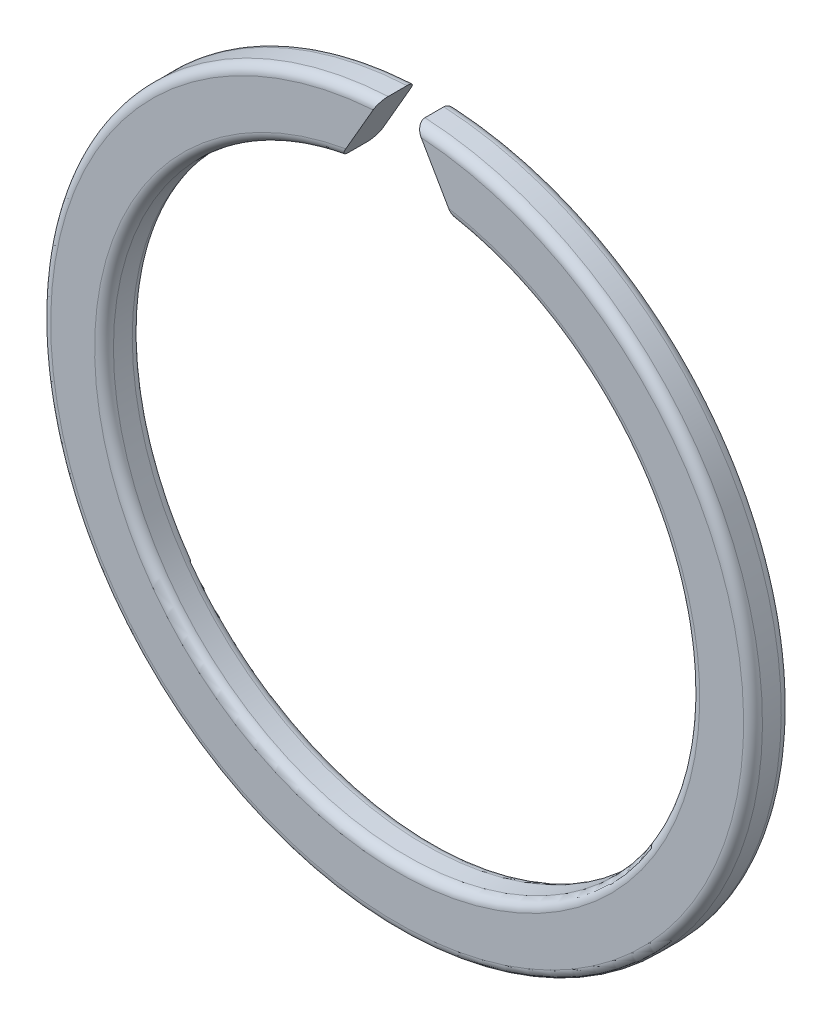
ISO-10303-21;
HEADER;
FILE_DESCRIPTION(('STEP AP214'),'2;1');
FILE_NAME('part.step','',(''),(''),'','','');
FILE_SCHEMA(('AUTOMOTIVE_DESIGN { 1 0 10303 214 1 1 1 1 }'));
ENDSEC;
DATA;
#1=APPLICATION_CONTEXT('core data for automotive mechanical design processes');
#2=APPLICATION_PROTOCOL_DEFINITION('international standard','automotive_design',2000,#1);
#3=PRODUCT_CONTEXT('',#1,'mechanical');
#4=PRODUCT('Part','Part','',(#3));
#5=PRODUCT_RELATED_PRODUCT_CATEGORY('part','',(#4));
#6=PRODUCT_DEFINITION_FORMATION('','',#4);
#7=PRODUCT_DEFINITION_CONTEXT('part definition',#1,'design');
#8=PRODUCT_DEFINITION('design','',#6,#7);
#9=PRODUCT_DEFINITION_SHAPE('','',#8);
#10=(LENGTH_UNIT() NAMED_UNIT(*) SI_UNIT(.MILLI.,.METRE.));
#11=(NAMED_UNIT(*) PLANE_ANGLE_UNIT() SI_UNIT($,.RADIAN.));
#12=(NAMED_UNIT(*) SI_UNIT($,.STERADIAN.) SOLID_ANGLE_UNIT());
#13=UNCERTAINTY_MEASURE_WITH_UNIT(LENGTH_MEASURE(1.E-05),#10,'distance_accuracy_value','');
#14=(GEOMETRIC_REPRESENTATION_CONTEXT(3) GLOBAL_UNCERTAINTY_ASSIGNED_CONTEXT((#13)) GLOBAL_UNIT_ASSIGNED_CONTEXT((#10,
#11,#12)) REPRESENTATION_CONTEXT('',''));
#15=CARTESIAN_POINT('',(0.,0.,0.));
#16=DIRECTION('',(0.,0.,1.));
#17=DIRECTION('',(1.,0.,0.));
#18=AXIS2_PLACEMENT_3D('',#15,#16,#17);
#19=CARTESIAN_POINT('',(0.,0.,1.2));
#20=DIRECTION('',(0.,0.,1.));
#21=DIRECTION('',(1.,0.,0.));
#22=AXIS2_PLACEMENT_3D('',#19,#20,#21);
#23=PLANE('',#22);
#24=DIRECTION('',(-0.500000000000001,0.866025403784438,0.));
#25=VECTOR('',#24,1.);
#26=CARTESIAN_POINT('',(0.,12.35,1.2));
#27=LINE('',#26,#25);
#28=CARTESIAN_POINT('',(1.63988152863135,9.5096418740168,1.2));
#29=VERTEX_POINT('',#28);
#30=CARTESIAN_POINT('',(0.765898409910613,11.0234250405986,1.2));
#31=VERTEX_POINT('',#30);
#32=EDGE_CURVE('E135',#29,#31,#27,.T.);
#33=ORIENTED_EDGE('',*,*,#32,.F.);
#34=CARTESIAN_POINT('',(0.,0.,1.2));
#35=DIRECTION('',(0.,0.,1.));
#36=DIRECTION('',(1.,0.,0.));
#37=AXIS2_PLACEMENT_3D('',#34,#35,#36);
#38=CIRCLE('',#37,9.65);
#39=CARTESIAN_POINT('',(-1.63988152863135,9.5096418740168,1.2));
#40=VERTEX_POINT('',#39);
#41=EDGE_CURVE('E11',#29,#40,#38,.F.);
#42=ORIENTED_EDGE('',*,*,#41,.T.);
#43=DIRECTION('',(-0.500000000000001,-0.866025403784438,0.));
#44=VECTOR('',#43,1.);
#45=CARTESIAN_POINT('',(0.,12.35,1.2));
#46=LINE('',#45,#44);
#47=CARTESIAN_POINT('',(-0.765898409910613,11.0234250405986,1.2));
#48=VERTEX_POINT('',#47);
#49=EDGE_CURVE('E134',#48,#40,#46,.T.);
#50=ORIENTED_EDGE('',*,*,#49,.F.);
#51=CARTESIAN_POINT('',(0.,0.,1.2));
#52=DIRECTION('',(0.,0.,1.));
#53=DIRECTION('',(1.,0.,0.));
#54=AXIS2_PLACEMENT_3D('',#51,#52,#53);
#55=CIRCLE('',#54,11.05);
#56=EDGE_CURVE('E48',#48,#31,#55,.T.);
#57=ORIENTED_EDGE('',*,*,#56,.T.);
#58=EDGE_LOOP('',(#33,#42,#50,#57));
#59=FACE_BOUND('',#58,.T.);
#60=ADVANCED_FACE('F39',(#59),#23,.T.);
#61=CARTESIAN_POINT('',(0.,0.,0.));
#62=DIRECTION('',(0.,0.,1.));
#63=DIRECTION('',(1.,0.,0.));
#64=AXIS2_PLACEMENT_3D('',#61,#62,#63);
#65=PLANE('',#64);
#66=DIRECTION('',(-0.500000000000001,-0.866025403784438,0.));
#67=VECTOR('',#66,1.);
#68=CARTESIAN_POINT('',(0.,12.35,0.));
#69=LINE('',#68,#67);
#70=CARTESIAN_POINT('',(-0.765898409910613,11.0234250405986,0.));
#71=VERTEX_POINT('',#70);
#72=CARTESIAN_POINT('',(-1.63988152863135,9.5096418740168,0.));
#73=VERTEX_POINT('',#72);
#74=EDGE_CURVE('E123',#71,#73,#69,.T.);
#75=ORIENTED_EDGE('',*,*,#74,.T.);
#76=CARTESIAN_POINT('',(0.,0.,0.));
#77=DIRECTION('',(0.,0.,1.));
#78=DIRECTION('',(1.,0.,0.));
#79=AXIS2_PLACEMENT_3D('',#76,#77,#78);
#80=CIRCLE('',#79,9.65);
#81=CARTESIAN_POINT('',(1.63988152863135,9.5096418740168,0.));
#82=VERTEX_POINT('',#81);
#83=EDGE_CURVE('E107',#73,#82,#80,.T.);
#84=ORIENTED_EDGE('',*,*,#83,.T.);
#85=DIRECTION('',(-0.500000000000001,0.866025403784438,0.));
#86=VECTOR('',#85,1.);
#87=CARTESIAN_POINT('',(0.,12.35,0.));
#88=LINE('',#87,#86);
#89=CARTESIAN_POINT('',(0.765898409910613,11.0234250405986,0.));
#90=VERTEX_POINT('',#89);
#91=EDGE_CURVE('E125',#82,#90,#88,.T.);
#92=ORIENTED_EDGE('',*,*,#91,.T.);
#93=CARTESIAN_POINT('',(0.,0.,0.));
#94=DIRECTION('',(0.,0.,1.));
#95=DIRECTION('',(1.,0.,0.));
#96=AXIS2_PLACEMENT_3D('',#93,#94,#95);
#97=CIRCLE('',#96,11.05);
#98=EDGE_CURVE('E129',#90,#71,#97,.F.);
#99=ORIENTED_EDGE('',*,*,#98,.T.);
#100=EDGE_LOOP('',(#75,#84,#92,#99));
#101=FACE_BOUND('',#100,.T.);
#102=ADVANCED_FACE('F122',(#101),#65,.F.);
#103=CARTESIAN_POINT('',(0.,0.,1.2));
#104=DIRECTION('',(0.,0.,-1.));
#105=DIRECTION('',(-1.,0.,0.));
#106=AXIS2_PLACEMENT_3D('',#103,#104,#105);
#107=CYLINDRICAL_SURFACE('',#106,11.35);
#108=DIRECTION('',(0.,0.,-1.));
#109=VECTOR('',#108,1.);
#110=CARTESIAN_POINT('',(-0.586092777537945,11.3348575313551,1.2));
#111=LINE('',#110,#109);
#112=CARTESIAN_POINT('',(-0.586092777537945,11.3348575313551,0.3));
#113=VERTEX_POINT('',#112);
#114=CARTESIAN_POINT('',(-0.586092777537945,11.3348575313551,0.9));
#115=VERTEX_POINT('',#114);
#116=EDGE_CURVE('E141',#113,#115,#111,.F.);
#117=ORIENTED_EDGE('',*,*,#116,.F.);
#118=CARTESIAN_POINT('',(0.,0.,0.3));
#119=DIRECTION('',(0.,0.,1.));
#120=DIRECTION('',(1.,0.,0.));
#121=AXIS2_PLACEMENT_3D('',#118,#119,#120);
#122=CIRCLE('',#121,11.35);
#123=CARTESIAN_POINT('',(0.586092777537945,11.3348575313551,0.3));
#124=VERTEX_POINT('',#123);
#125=EDGE_CURVE('E212',#113,#124,#122,.T.);
#126=ORIENTED_EDGE('',*,*,#125,.T.);
#127=DIRECTION('',(0.,0.,-1.));
#128=VECTOR('',#127,1.);
#129=CARTESIAN_POINT('',(0.586092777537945,11.3348575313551,1.2));
#130=LINE('',#129,#128);
#131=CARTESIAN_POINT('',(0.586092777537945,11.3348575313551,0.9));
#132=VERTEX_POINT('',#131);
#133=EDGE_CURVE('E143',#132,#124,#130,.T.);
#134=ORIENTED_EDGE('',*,*,#133,.F.);
#135=CARTESIAN_POINT('',(0.,0.,0.9));
#136=DIRECTION('',(0.,0.,1.));
#137=DIRECTION('',(1.,0.,0.));
#138=AXIS2_PLACEMENT_3D('',#135,#136,#137);
#139=CIRCLE('',#138,11.35);
#140=EDGE_CURVE('E213',#132,#115,#139,.F.);
#141=ORIENTED_EDGE('',*,*,#140,.T.);
#142=EDGE_LOOP('',(#117,#126,#134,#141));
#143=FACE_BOUND('',#142,.T.);
#144=ADVANCED_FACE('F232',(#143),#107,.T.);
#145=CARTESIAN_POINT('',(0.,0.,1.2));
#146=DIRECTION('',(0.,0.,-1.));
#147=DIRECTION('',(-1.,0.,0.));
#148=AXIS2_PLACEMENT_3D('',#145,#146,#147);
#149=CYLINDRICAL_SURFACE('',#148,9.35);
#150=DIRECTION('',(0.,0.,-1.));
#151=VECTOR('',#150,1.);
#152=CARTESIAN_POINT('',(1.83729823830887,9.16770610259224,1.2));
#153=LINE('',#152,#151);
#154=CARTESIAN_POINT('',(1.83729823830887,9.16770610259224,0.9));
#155=VERTEX_POINT('',#154);
#156=CARTESIAN_POINT('',(1.83729823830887,9.16770610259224,0.3));
#157=VERTEX_POINT('',#156);
#158=EDGE_CURVE('E136',#155,#157,#153,.T.);
#159=ORIENTED_EDGE('',*,*,#158,.T.);
#160=CARTESIAN_POINT('',(0.,0.,0.3));
#161=DIRECTION('',(0.,0.,1.));
#162=DIRECTION('',(1.,0.,0.));
#163=AXIS2_PLACEMENT_3D('',#160,#161,#162);
#164=CIRCLE('',#163,9.35);
#165=CARTESIAN_POINT('',(-1.83729823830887,9.16770610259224,0.3));
#166=VERTEX_POINT('',#165);
#167=EDGE_CURVE('E109',#157,#166,#164,.F.);
#168=ORIENTED_EDGE('',*,*,#167,.T.);
#169=DIRECTION('',(0.,0.,-1.));
#170=VECTOR('',#169,1.);
#171=CARTESIAN_POINT('',(-1.83729823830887,9.16770610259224,1.2));
#172=LINE('',#171,#170);
#173=CARTESIAN_POINT('',(-1.83729823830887,9.16770610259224,0.9));
#174=VERTEX_POINT('',#173);
#175=EDGE_CURVE('E137',#174,#166,#172,.T.);
#176=ORIENTED_EDGE('',*,*,#175,.F.);
#177=CARTESIAN_POINT('',(0.,0.,0.9));
#178=DIRECTION('',(0.,0.,1.));
#179=DIRECTION('',(1.,0.,0.));
#180=AXIS2_PLACEMENT_3D('',#177,#178,#179);
#181=CIRCLE('',#180,9.35);
#182=EDGE_CURVE('E114',#174,#155,#181,.T.);
#183=ORIENTED_EDGE('',*,*,#182,.T.);
#184=EDGE_LOOP('',(#159,#168,#176,#183));
#185=FACE_BOUND('',#184,.T.);
#186=ADVANCED_FACE('F168',(#185),#149,.F.);
#187=CARTESIAN_POINT('',(0.,12.35,1.2));
#188=DIRECTION('',(0.866025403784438,-0.500000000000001,0.));
#189=DIRECTION('',(0.500000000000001,0.866025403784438,0.));
#190=AXIS2_PLACEMENT_3D('',#187,#188,#189);
#191=PLANE('',#190);
#192=ORIENTED_EDGE('',*,*,#175,.T.);
#193=CARTESIAN_POINT('',(-1.83729823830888,9.16770610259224,0.3));
#194=CARTESIAN_POINT('',(-1.8373132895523,9.16768003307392,0.28601958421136));
#195=CARTESIAN_POINT('',(-1.83664855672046,9.16883138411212,0.272069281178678));
#196=CARTESIAN_POINT('',(-1.83408882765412,9.17326496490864,0.244732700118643));
#197=CARTESIAN_POINT('',(-1.83220321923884,9.17653093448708,0.231342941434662));
#198=CARTESIAN_POINT('',(-1.82733309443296,9.18496623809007,0.205436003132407));
#199=CARTESIAN_POINT('',(-1.82435106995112,9.19013125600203,0.192916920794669));
#200=CARTESIAN_POINT('',(-1.81745859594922,9.20206937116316,0.168929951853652));
#201=CARTESIAN_POINT('',(-1.81354631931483,9.20884563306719,0.157464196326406));
#202=CARTESIAN_POINT('',(-1.80344507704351,9.22634149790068,0.131881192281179));
#203=CARTESIAN_POINT('',(-1.79694045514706,9.23760783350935,0.11826238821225));
#204=CARTESIAN_POINT('',(-1.78291540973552,9.26189992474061,0.0933149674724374));
#205=CARTESIAN_POINT('',(-1.77539334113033,9.27492852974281,0.0819901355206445));
#206=CARTESIAN_POINT('',(-1.75727514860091,9.30631015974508,0.0585728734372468));
#207=CARTESIAN_POINT('',(-1.74642987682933,9.32509472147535,0.0472528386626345));
#208=CARTESIAN_POINT('',(-1.72396465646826,9.36400562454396,0.0282718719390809));
#209=CARTESIAN_POINT('',(-1.71234364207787,9.3841338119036,0.0206160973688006));
#210=CARTESIAN_POINT('',(-1.69057737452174,9.42183409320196,0.00979952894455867));
#211=CARTESIAN_POINT('',(-1.68049585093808,9.43929580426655,0.0061134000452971));
#212=CARTESIAN_POINT('',(-1.66023573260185,9.47438735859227,0.00122372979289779));
#213=CARTESIAN_POINT('',(-1.65005790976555,9.49201586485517,7.44482155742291E-06));
#214=CARTESIAN_POINT('',(-1.63988152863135,9.5096418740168,0.));
#215=B_SPLINE_CURVE_WITH_KNOTS('',3,(#193,#194,#195,#196,#197,#198,#199,#200,#201,#202,#203,
#204,#205,#206,#207,#208,#209,#210,#211,#212,#213,#214),.UNSPECIFIED.,.F.,.F.,(4,2,2,2,2,2,2,2,
2,2,4),(0.,0.0418304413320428,0.0833429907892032,0.124761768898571,0.1662625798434,
0.222456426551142,0.278742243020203,0.351758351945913,0.424876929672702,0.486220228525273,
0.54724620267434),.UNSPECIFIED.);
#216=EDGE_CURVE('E197',#166,#73,#215,.T.);
#217=ORIENTED_EDGE('',*,*,#216,.T.);
#218=ORIENTED_EDGE('',*,*,#74,.F.);
#219=CARTESIAN_POINT('',(-0.765898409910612,11.0234250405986,0.));
#220=CARTESIAN_POINT('',(-0.753199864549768,11.0454195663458,7.80616742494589E-07));
#221=CARTESIAN_POINT('',(-0.740477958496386,11.0674545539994,0.0022200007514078));
#222=CARTESIAN_POINT('',(-0.715321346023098,11.1110270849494,0.0112042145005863));
#223=CARTESIAN_POINT('',(-0.702890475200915,11.1325579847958,0.0180118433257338));
#224=CARTESIAN_POINT('',(-0.679736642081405,11.1726616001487,0.0356521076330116));
#225=CARTESIAN_POINT('',(-0.668955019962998,11.1913359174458,0.0461734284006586));
#226=CARTESIAN_POINT('',(-0.648667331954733,11.2264752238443,0.0712212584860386));
#227=CARTESIAN_POINT('',(-0.639155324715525,11.2429505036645,0.085728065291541));
#228=CARTESIAN_POINT('',(-0.624596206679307,11.2681676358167,0.113490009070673));
#229=CARTESIAN_POINT('',(-0.619075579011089,11.2777296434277,0.125758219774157));
#230=CARTESIAN_POINT('',(-0.609114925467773,11.2949820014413,0.151964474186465));
#231=CARTESIAN_POINT('',(-0.604675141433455,11.3026719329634,0.165902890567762));
#232=CARTESIAN_POINT('',(-0.597077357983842,11.315831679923,0.195240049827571));
#233=CARTESIAN_POINT('',(-0.593928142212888,11.3212862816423,0.210647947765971));
#234=CARTESIAN_POINT('',(-0.589154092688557,11.3295551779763,0.242365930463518));
#235=CARTESIAN_POINT('',(-0.587525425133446,11.3323761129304,0.258673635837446));
#236=CARTESIAN_POINT('',(-0.586503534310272,11.3341460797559,0.279250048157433));
#237=CARTESIAN_POINT('',(-0.586349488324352,11.3344128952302,0.283397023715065));
#238=CARTESIAN_POINT('',(-0.586144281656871,11.3347683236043,0.291695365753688));
#239=CARTESIAN_POINT('',(-0.586092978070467,11.3348571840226,0.295846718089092));
#240=CARTESIAN_POINT('',(-0.586092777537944,11.3348575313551,0.3));
#241=B_SPLINE_CURVE_WITH_KNOTS('',3,(#219,#220,#221,#222,#223,#224,#225,#226,#227,#228,#229,
#230,#231,#232,#233,#234,#235,#236,#237,#238,#239,#240),.UNSPECIFIED.,.F.,.F.,(4,2,2,2,2,2,2,2,
2,2,4),(0.,0.0761739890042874,0.153065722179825,0.224633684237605,0.295854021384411,
0.345173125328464,0.39450325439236,0.444163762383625,0.493698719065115,0.506170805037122,
0.518625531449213),.UNSPECIFIED.);
#242=EDGE_CURVE('E194',#71,#113,#241,.T.);
#243=ORIENTED_EDGE('',*,*,#242,.T.);
#244=ORIENTED_EDGE('',*,*,#116,.T.);
#245=CARTESIAN_POINT('',(-0.586092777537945,11.3348575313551,0.9));
#246=CARTESIAN_POINT('',(-0.586080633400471,11.3348785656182,0.914935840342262));
#247=CARTESIAN_POINT('',(-0.586756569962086,11.3337078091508,0.929852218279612));
#248=CARTESIAN_POINT('',(-0.58938524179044,11.3291548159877,0.959154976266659));
#249=CARTESIAN_POINT('',(-0.591331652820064,11.325783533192,0.973543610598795));
#250=CARTESIAN_POINT('',(-0.596400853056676,11.3170034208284,1.00144021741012));
#251=CARTESIAN_POINT('',(-0.599522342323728,11.3115968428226,1.01494914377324));
#252=CARTESIAN_POINT('',(-0.606794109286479,11.2990017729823,1.04081763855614));
#253=CARTESIAN_POINT('',(-0.610945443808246,11.2918114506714,1.05317600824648));
#254=CARTESIAN_POINT('',(-0.620382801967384,11.2754654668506,1.07721136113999));
#255=CARTESIAN_POINT('',(-0.625721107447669,11.2662192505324,1.08880583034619));
#256=CARTESIAN_POINT('',(-0.637176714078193,11.2463775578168,1.11032260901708));
#257=CARTESIAN_POINT('',(-0.643294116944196,11.2357819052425,1.12024469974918));
#258=CARTESIAN_POINT('',(-0.657117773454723,11.2118386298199,1.13973613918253));
#259=CARTESIAN_POINT('',(-0.664924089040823,11.1983176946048,1.14902131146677));
#260=CARTESIAN_POINT('',(-0.681126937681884,11.1702535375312,1.16527199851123));
#261=CARTESIAN_POINT('',(-0.689524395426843,11.1557087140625,1.17223377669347));
#262=CARTESIAN_POINT('',(-0.709021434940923,11.1219388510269,1.18539834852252));
#263=CARTESIAN_POINT('',(-0.720240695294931,11.1025065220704,1.19089434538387));
#264=CARTESIAN_POINT('',(-0.742945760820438,11.0631801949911,1.19819010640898));
#265=CARTESIAN_POINT('',(-0.754430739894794,11.0432876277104,1.20000008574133));
#266=CARTESIAN_POINT('',(-0.765898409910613,11.0234250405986,1.2));
#267=B_SPLINE_CURVE_WITH_KNOTS('',3,(#245,#246,#247,#248,#249,#250,#251,#252,#253,#254,#255,
#256,#257,#258,#259,#260,#261,#262,#263,#264,#265,#266),.UNSPECIFIED.,.F.,.F.,(4,2,2,2,2,2,2,2,
2,2,4),(0.,0.0447158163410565,0.0892107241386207,0.133656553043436,0.178148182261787,
0.225250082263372,0.272358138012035,0.326645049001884,0.381018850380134,0.450005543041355,
0.518800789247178),.UNSPECIFIED.);
#268=EDGE_CURVE('E58',#115,#48,#267,.T.);
#269=ORIENTED_EDGE('',*,*,#268,.T.);
#270=ORIENTED_EDGE('',*,*,#49,.T.);
#271=CARTESIAN_POINT('',(-1.63988152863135,9.5096418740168,1.2));
#272=CARTESIAN_POINT('',(-1.65252408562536,9.48774432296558,1.19998464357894));
#273=CARTESIAN_POINT('',(-1.66518073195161,9.46582236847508,1.19810986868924));
#274=CARTESIAN_POINT('',(-1.69028872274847,9.42233405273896,1.19054833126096));
#275=CARTESIAN_POINT('',(-1.70273818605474,9.40077094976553,1.18483674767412));
#276=CARTESIAN_POINT('',(-1.7259318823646,9.36059828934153,1.1701965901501));
#277=CARTESIAN_POINT('',(-1.73672874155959,9.34189758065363,1.1616038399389));
#278=CARTESIAN_POINT('',(-1.75748097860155,9.30595365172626,1.14106547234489));
#279=CARTESIAN_POINT('',(-1.76743834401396,9.28870698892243,1.12912808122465));
#280=CARTESIAN_POINT('',(-1.78384343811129,9.2602925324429,1.10508177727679));
#281=CARTESIAN_POINT('',(-1.79055918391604,9.24866051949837,1.09370510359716));
#282=CARTESIAN_POINT('',(-1.80300180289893,9.22710927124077,1.06894855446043));
#283=CARTESIAN_POINT('',(-1.80872969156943,9.21718827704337,1.05557076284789));
#284=CARTESIAN_POINT('',(-1.8179321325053,9.20124918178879,1.02960332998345));
#285=CARTESIAN_POINT('',(-1.82162757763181,9.19484848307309,1.01732772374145));
#286=CARTESIAN_POINT('',(-1.82795121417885,9.18389562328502,0.991733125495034));
#287=CARTESIAN_POINT('',(-1.83058157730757,9.17933970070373,0.978416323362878));
#288=CARTESIAN_POINT('',(-1.83413388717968,9.173186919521,0.954259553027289));
#289=CARTESIAN_POINT('',(-1.8353115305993,9.17114718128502,0.943568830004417));
#290=CARTESIAN_POINT('',(-1.83689790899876,9.16839949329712,0.921923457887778));
#291=CARTESIAN_POINT('',(-1.83730384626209,9.16769638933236,0.910967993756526));
#292=CARTESIAN_POINT('',(-1.83729823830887,9.16770610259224,0.9));
#293=B_SPLINE_CURVE_WITH_KNOTS('',3,(#271,#272,#273,#274,#275,#276,#277,#278,#279,#280,#281,
#282,#283,#284,#285,#286,#287,#288,#289,#290,#291,#292),.UNSPECIFIED.,.F.,.F.,(4,2,2,2,2,2,2,2,
2,2,4),(0.,0.0758360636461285,0.152167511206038,0.221628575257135,0.290920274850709,
0.343541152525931,0.396107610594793,0.438924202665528,0.481653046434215,0.514387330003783,
0.54724006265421),.UNSPECIFIED.);
#294=EDGE_CURVE('E199',#40,#174,#293,.T.);
#295=ORIENTED_EDGE('',*,*,#294,.T.);
#296=EDGE_LOOP('',(#192,#217,#218,#243,#244,#269,#270,#295));
#297=FACE_BOUND('',#296,.T.);
#298=ADVANCED_FACE('F165',(#297),#191,.T.);
#299=CARTESIAN_POINT('',(0.,12.35,1.2));
#300=DIRECTION('',(-0.866025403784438,-0.500000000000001,0.));
#301=DIRECTION('',(0.500000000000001,-0.866025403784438,0.));
#302=AXIS2_PLACEMENT_3D('',#299,#300,#301);
#303=PLANE('',#302);
#304=ORIENTED_EDGE('',*,*,#91,.F.);
#305=CARTESIAN_POINT('',(1.63988152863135,9.5096418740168,0.));
#306=CARTESIAN_POINT('',(1.65252408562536,9.48774432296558,1.53564210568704E-05));
#307=CARTESIAN_POINT('',(1.66518073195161,9.46582236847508,0.00189013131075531));
#308=CARTESIAN_POINT('',(1.69028872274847,9.42233405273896,0.00945166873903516));
#309=CARTESIAN_POINT('',(1.70273818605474,9.40077094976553,0.0151632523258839));
#310=CARTESIAN_POINT('',(1.7259318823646,9.36059828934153,0.0298034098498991));
#311=CARTESIAN_POINT('',(1.73672874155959,9.34189758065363,0.0383961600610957));
#312=CARTESIAN_POINT('',(1.75748097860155,9.30595365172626,0.0589345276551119));
#313=CARTESIAN_POINT('',(1.76743834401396,9.28870698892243,0.0708719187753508));
#314=CARTESIAN_POINT('',(1.78384343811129,9.2602925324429,0.0949182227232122));
#315=CARTESIAN_POINT('',(1.79055918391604,9.24866051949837,0.106294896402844));
#316=CARTESIAN_POINT('',(1.80300180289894,9.22710927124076,0.131051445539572));
#317=CARTESIAN_POINT('',(1.80872969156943,9.21718827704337,0.144429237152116));
#318=CARTESIAN_POINT('',(1.8179321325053,9.20124918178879,0.170396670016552));
#319=CARTESIAN_POINT('',(1.82162757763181,9.19484848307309,0.182672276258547));
#320=CARTESIAN_POINT('',(1.82795121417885,9.18389562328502,0.208266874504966));
#321=CARTESIAN_POINT('',(1.83058157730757,9.17933970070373,0.221583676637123));
#322=CARTESIAN_POINT('',(1.83413388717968,9.173186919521,0.245740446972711));
#323=CARTESIAN_POINT('',(1.8353115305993,9.17114718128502,0.256431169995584));
#324=CARTESIAN_POINT('',(1.83689790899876,9.16839949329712,0.278076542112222));
#325=CARTESIAN_POINT('',(1.83730384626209,9.16769638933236,0.289032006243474));
#326=CARTESIAN_POINT('',(1.83729823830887,9.16770610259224,0.3));
#327=B_SPLINE_CURVE_WITH_KNOTS('',3,(#305,#306,#307,#308,#309,#310,#311,#312,#313,#314,#315,
#316,#317,#318,#319,#320,#321,#322,#323,#324,#325,#326),.UNSPECIFIED.,.F.,.F.,(4,2,2,2,2,2,2,2,
2,2,4),(0.,0.0758360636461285,0.152167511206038,0.221628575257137,0.290920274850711,
0.343541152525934,0.396107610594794,0.438924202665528,0.481653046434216,0.514387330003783,
0.547240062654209),.UNSPECIFIED.);
#328=EDGE_CURVE('E102',#82,#157,#327,.T.);
#329=ORIENTED_EDGE('',*,*,#328,.T.);
#330=ORIENTED_EDGE('',*,*,#158,.F.);
#331=CARTESIAN_POINT('',(1.83729823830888,9.16770610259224,0.9));
#332=CARTESIAN_POINT('',(1.8373132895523,9.16768003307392,0.91398041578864));
#333=CARTESIAN_POINT('',(1.83664855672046,9.16883138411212,0.927930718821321));
#334=CARTESIAN_POINT('',(1.83408882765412,9.17326496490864,0.955267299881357));
#335=CARTESIAN_POINT('',(1.83220321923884,9.17653093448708,0.968657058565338));
#336=CARTESIAN_POINT('',(1.82733309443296,9.18496623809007,0.994563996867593));
#337=CARTESIAN_POINT('',(1.82435106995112,9.19013125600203,1.00708307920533));
#338=CARTESIAN_POINT('',(1.81745859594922,9.20206937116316,1.03107004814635));
#339=CARTESIAN_POINT('',(1.81354631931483,9.20884563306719,1.04253580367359));
#340=CARTESIAN_POINT('',(1.80344507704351,9.22634149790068,1.06811880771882));
#341=CARTESIAN_POINT('',(1.79694045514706,9.23760783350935,1.08173761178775));
#342=CARTESIAN_POINT('',(1.78291540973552,9.26189992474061,1.10668503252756));
#343=CARTESIAN_POINT('',(1.77539334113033,9.27492852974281,1.11800986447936));
#344=CARTESIAN_POINT('',(1.75727514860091,9.30631015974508,1.14142712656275));
#345=CARTESIAN_POINT('',(1.74642987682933,9.32509472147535,1.15274716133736));
#346=CARTESIAN_POINT('',(1.72396465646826,9.36400562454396,1.17172812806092));
#347=CARTESIAN_POINT('',(1.71234364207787,9.3841338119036,1.1793839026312));
#348=CARTESIAN_POINT('',(1.69057737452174,9.42183409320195,1.19020047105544));
#349=CARTESIAN_POINT('',(1.68049585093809,9.43929580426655,1.1938865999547));
#350=CARTESIAN_POINT('',(1.66023573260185,9.47438735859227,1.1987762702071));
#351=CARTESIAN_POINT('',(1.65005790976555,9.49201586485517,1.19999255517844));
#352=CARTESIAN_POINT('',(1.63988152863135,9.5096418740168,1.2));
#353=B_SPLINE_CURVE_WITH_KNOTS('',3,(#331,#332,#333,#334,#335,#336,#337,#338,#339,#340,#341,
#342,#343,#344,#345,#346,#347,#348,#349,#350,#351,#352),.UNSPECIFIED.,.F.,.F.,(4,2,2,2,2,2,2,2,
2,2,4),(0.,0.0418304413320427,0.0833429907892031,0.12476176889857,0.1662625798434,
0.222456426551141,0.278742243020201,0.351758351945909,0.424876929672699,0.486220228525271,
0.547246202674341),.UNSPECIFIED.);
#354=EDGE_CURVE('E152',#155,#29,#353,.T.);
#355=ORIENTED_EDGE('',*,*,#354,.T.);
#356=ORIENTED_EDGE('',*,*,#32,.T.);
#357=CARTESIAN_POINT('',(0.765898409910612,11.0234250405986,1.2));
#358=CARTESIAN_POINT('',(0.753199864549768,11.0454195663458,1.19999921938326));
#359=CARTESIAN_POINT('',(0.740477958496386,11.0674545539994,1.19777999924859));
#360=CARTESIAN_POINT('',(0.715321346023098,11.1110270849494,1.18879578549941));
#361=CARTESIAN_POINT('',(0.702890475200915,11.1325579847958,1.18198815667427));
#362=CARTESIAN_POINT('',(0.679736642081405,11.1726616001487,1.16434789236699));
#363=CARTESIAN_POINT('',(0.668955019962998,11.1913359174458,1.15382657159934));
#364=CARTESIAN_POINT('',(0.648667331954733,11.2264752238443,1.12877874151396));
#365=CARTESIAN_POINT('',(0.639155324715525,11.2429505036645,1.11427193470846));
#366=CARTESIAN_POINT('',(0.624596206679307,11.2681676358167,1.08650999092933));
#367=CARTESIAN_POINT('',(0.619075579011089,11.2777296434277,1.07424178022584));
#368=CARTESIAN_POINT('',(0.609114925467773,11.2949820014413,1.04803552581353));
#369=CARTESIAN_POINT('',(0.604675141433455,11.3026719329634,1.03409710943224));
#370=CARTESIAN_POINT('',(0.597077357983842,11.315831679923,1.00475995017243));
#371=CARTESIAN_POINT('',(0.593928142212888,11.3212862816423,0.989352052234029));
#372=CARTESIAN_POINT('',(0.589154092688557,11.3295551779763,0.957634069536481));
#373=CARTESIAN_POINT('',(0.587525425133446,11.3323761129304,0.941326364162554));
#374=CARTESIAN_POINT('',(0.586503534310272,11.3341460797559,0.920749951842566));
#375=CARTESIAN_POINT('',(0.586349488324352,11.3344128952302,0.916602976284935));
#376=CARTESIAN_POINT('',(0.586144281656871,11.3347683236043,0.908304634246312));
#377=CARTESIAN_POINT('',(0.586092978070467,11.3348571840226,0.904153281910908));
#378=CARTESIAN_POINT('',(0.586092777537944,11.3348575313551,0.9));
#379=B_SPLINE_CURVE_WITH_KNOTS('',3,(#357,#358,#359,#360,#361,#362,#363,#364,#365,#366,#367,
#368,#369,#370,#371,#372,#373,#374,#375,#376,#377,#378),.UNSPECIFIED.,.F.,.F.,(4,2,2,2,2,2,2,2,
2,2,4),(0.,0.0761739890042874,0.153065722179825,0.224633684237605,0.295854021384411,
0.345173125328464,0.39450325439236,0.444163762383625,0.493698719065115,0.506170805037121,
0.518625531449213),.UNSPECIFIED.);
#380=EDGE_CURVE('E128',#31,#132,#379,.T.);
#381=ORIENTED_EDGE('',*,*,#380,.T.);
#382=ORIENTED_EDGE('',*,*,#133,.T.);
#383=CARTESIAN_POINT('',(0.586092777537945,11.3348575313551,0.3));
#384=CARTESIAN_POINT('',(0.586080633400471,11.3348785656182,0.285064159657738));
#385=CARTESIAN_POINT('',(0.586756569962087,11.3337078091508,0.270147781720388));
#386=CARTESIAN_POINT('',(0.589385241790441,11.3291548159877,0.240845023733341));
#387=CARTESIAN_POINT('',(0.591331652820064,11.325783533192,0.226456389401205));
#388=CARTESIAN_POINT('',(0.596400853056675,11.3170034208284,0.198559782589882));
#389=CARTESIAN_POINT('',(0.599522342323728,11.3115968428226,0.185050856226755));
#390=CARTESIAN_POINT('',(0.606794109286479,11.2990017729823,0.159182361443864));
#391=CARTESIAN_POINT('',(0.610945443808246,11.2918114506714,0.146823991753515));
#392=CARTESIAN_POINT('',(0.620382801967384,11.2754654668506,0.122788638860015));
#393=CARTESIAN_POINT('',(0.625721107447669,11.2662192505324,0.111194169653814));
#394=CARTESIAN_POINT('',(0.637176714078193,11.2463775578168,0.0896773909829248));
#395=CARTESIAN_POINT('',(0.643294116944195,11.2357819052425,0.0797553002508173));
#396=CARTESIAN_POINT('',(0.657117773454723,11.2118386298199,0.0602638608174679));
#397=CARTESIAN_POINT('',(0.664924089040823,11.1983176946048,0.0509786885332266));
#398=CARTESIAN_POINT('',(0.681126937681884,11.1702535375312,0.0347280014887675));
#399=CARTESIAN_POINT('',(0.689524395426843,11.1557087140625,0.0277662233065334));
#400=CARTESIAN_POINT('',(0.709021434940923,11.1219388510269,0.0146016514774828));
#401=CARTESIAN_POINT('',(0.720240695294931,11.1025065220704,0.00910565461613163));
#402=CARTESIAN_POINT('',(0.742945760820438,11.0631801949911,0.00180989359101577));
#403=CARTESIAN_POINT('',(0.754430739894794,11.0432876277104,-8.57413333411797E-08));
#404=CARTESIAN_POINT('',(0.765898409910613,11.0234250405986,0.));
#405=B_SPLINE_CURVE_WITH_KNOTS('',3,(#383,#384,#385,#386,#387,#388,#389,#390,#391,#392,#393,
#394,#395,#396,#397,#398,#399,#400,#401,#402,#403,#404),.UNSPECIFIED.,.F.,.F.,(4,2,2,2,2,2,2,2,
2,2,4),(0.,0.0447158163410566,0.0892107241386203,0.133656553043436,0.178148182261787,
0.225250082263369,0.272358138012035,0.326645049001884,0.381018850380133,0.450005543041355,
0.518800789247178),.UNSPECIFIED.);
#406=EDGE_CURVE('E116',#124,#90,#405,.T.);
#407=ORIENTED_EDGE('',*,*,#406,.T.);
#408=EDGE_LOOP('',(#304,#329,#330,#355,#356,#381,#382,#407));
#409=FACE_BOUND('',#408,.T.);
#410=ADVANCED_FACE('F130',(#409),#303,.T.);
#411=CARTESIAN_POINT('',(0.,0.,0.3));
#412=DIRECTION('',(0.,0.,1.));
#413=DIRECTION('',(1.,0.,0.));
#414=AXIS2_PLACEMENT_3D('',#411,#412,#413);
#415=TOROIDAL_SURFACE('',#414,9.65,0.3);
#416=ORIENTED_EDGE('',*,*,#216,.F.);
#417=ORIENTED_EDGE('',*,*,#167,.F.);
#418=ORIENTED_EDGE('',*,*,#328,.F.);
#419=ORIENTED_EDGE('',*,*,#83,.F.);
#420=EDGE_LOOP('',(#416,#417,#418,#419));
#421=FACE_BOUND('',#420,.T.);
#422=ADVANCED_FACE('F108',(#421),#415,.T.);
#423=CARTESIAN_POINT('',(0.,0.,0.3));
#424=DIRECTION('',(0.,0.,1.));
#425=DIRECTION('',(1.,0.,0.));
#426=AXIS2_PLACEMENT_3D('',#423,#424,#425);
#427=TOROIDAL_SURFACE('',#426,11.05,0.3);
#428=ORIENTED_EDGE('',*,*,#242,.F.);
#429=ORIENTED_EDGE('',*,*,#98,.F.);
#430=ORIENTED_EDGE('',*,*,#406,.F.);
#431=ORIENTED_EDGE('',*,*,#125,.F.);
#432=EDGE_LOOP('',(#428,#429,#430,#431));
#433=FACE_BOUND('',#432,.T.);
#434=ADVANCED_FACE('F185',(#433),#427,.T.);
#435=CARTESIAN_POINT('',(0.,0.,0.9));
#436=DIRECTION('',(0.,0.,1.));
#437=DIRECTION('',(1.,0.,0.));
#438=AXIS2_PLACEMENT_3D('',#435,#436,#437);
#439=TOROIDAL_SURFACE('',#438,9.65,0.3);
#440=ORIENTED_EDGE('',*,*,#294,.F.);
#441=ORIENTED_EDGE('',*,*,#41,.F.);
#442=ORIENTED_EDGE('',*,*,#354,.F.);
#443=ORIENTED_EDGE('',*,*,#182,.F.);
#444=EDGE_LOOP('',(#440,#441,#442,#443));
#445=FACE_BOUND('',#444,.T.);
#446=ADVANCED_FACE('F184',(#445),#439,.T.);
#447=CARTESIAN_POINT('',(0.,0.,0.9));
#448=DIRECTION('',(0.,0.,1.));
#449=DIRECTION('',(1.,0.,0.));
#450=AXIS2_PLACEMENT_3D('',#447,#448,#449);
#451=TOROIDAL_SURFACE('',#450,11.05,0.3);
#452=ORIENTED_EDGE('',*,*,#268,.F.);
#453=ORIENTED_EDGE('',*,*,#140,.F.);
#454=ORIENTED_EDGE('',*,*,#380,.F.);
#455=ORIENTED_EDGE('',*,*,#56,.F.);
#456=EDGE_LOOP('',(#452,#453,#454,#455));
#457=FACE_BOUND('',#456,.T.);
#458=ADVANCED_FACE('F41',(#457),#451,.T.);
#459=CLOSED_SHELL('',(#60,#102,#144,#186,#298,#410,#422,#434,#446,#458));
#460=MANIFOLD_SOLID_BREP('B2',#459);
#461=ADVANCED_BREP_SHAPE_REPRESENTATION('',(#18,#460),#14);
#462=SHAPE_DEFINITION_REPRESENTATION(#9,#461);
ENDSEC;
END-ISO-10303-21;
